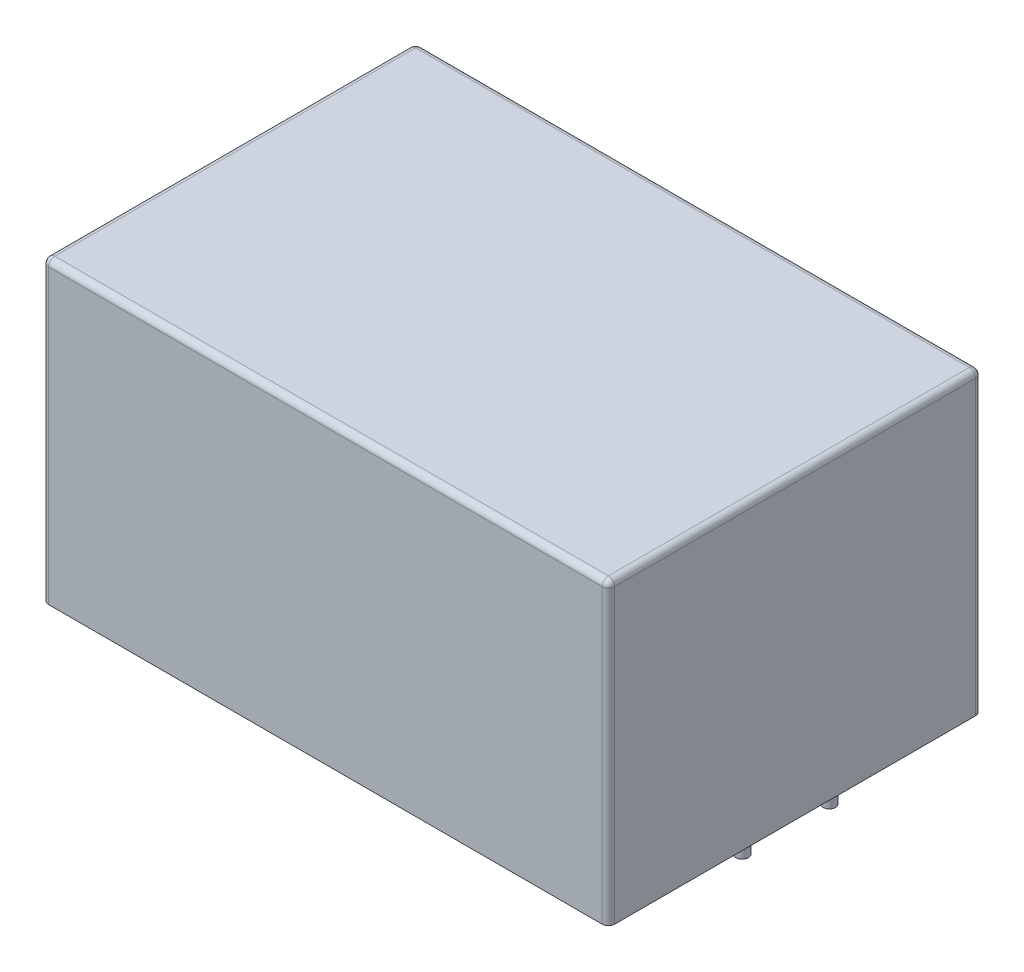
ISO-10303-21;
HEADER;
FILE_DESCRIPTION(('STEP AP214'),'2;1');
FILE_NAME('part.step','',(''),(''),'','','');
FILE_SCHEMA(('AUTOMOTIVE_DESIGN { 1 0 10303 214 1 1 1 1 }'));
ENDSEC;
DATA;
#1=APPLICATION_CONTEXT('core data for automotive mechanical design processes');
#2=APPLICATION_PROTOCOL_DEFINITION('international standard','automotive_design',2000,#1);
#3=PRODUCT_CONTEXT('',#1,'mechanical');
#4=PRODUCT('Part','Part','',(#3));
#5=PRODUCT_RELATED_PRODUCT_CATEGORY('part','',(#4));
#6=PRODUCT_DEFINITION_FORMATION('','',#4);
#7=PRODUCT_DEFINITION_CONTEXT('part definition',#1,'design');
#8=PRODUCT_DEFINITION('design','',#6,#7);
#9=PRODUCT_DEFINITION_SHAPE('','',#8);
#10=(LENGTH_UNIT() NAMED_UNIT(*) SI_UNIT(.MILLI.,.METRE.));
#11=(NAMED_UNIT(*) PLANE_ANGLE_UNIT() SI_UNIT($,.RADIAN.));
#12=(NAMED_UNIT(*) SI_UNIT($,.STERADIAN.) SOLID_ANGLE_UNIT());
#13=UNCERTAINTY_MEASURE_WITH_UNIT(LENGTH_MEASURE(1.E-05),#10,'distance_accuracy_value','');
#14=(GEOMETRIC_REPRESENTATION_CONTEXT(3) GLOBAL_UNCERTAINTY_ASSIGNED_CONTEXT((#13)) GLOBAL_UNIT_ASSIGNED_CONTEXT((#10,
#11,#12)) REPRESENTATION_CONTEXT('',''));
#15=CARTESIAN_POINT('',(0.,0.,0.));
#16=DIRECTION('',(0.,0.,1.));
#17=DIRECTION('',(1.,0.,0.));
#18=AXIS2_PLACEMENT_3D('',#15,#16,#17);
#19=CARTESIAN_POINT('',(-22.75,24.,-15.));
#20=DIRECTION('',(1.,0.,0.));
#21=DIRECTION('',(0.,0.,-1.));
#22=AXIS2_PLACEMENT_3D('',#19,#20,#21);
#23=PLANE('',#22);
#24=DIRECTION('',(0.,0.,1.));
#25=VECTOR('',#24,1.);
#26=CARTESIAN_POINT('',(-22.75,23.5,-15.));
#27=LINE('',#26,#25);
#28=CARTESIAN_POINT('',(-22.75,23.5,14.5));
#29=VERTEX_POINT('',#28);
#30=CARTESIAN_POINT('',(-22.75,23.5,-14.5));
#31=VERTEX_POINT('',#30);
#32=EDGE_CURVE('E51',#29,#31,#27,.F.);
#33=ORIENTED_EDGE('',*,*,#32,.T.);
#34=DIRECTION('',(0.,-1.,0.));
#35=VECTOR('',#34,1.);
#36=CARTESIAN_POINT('',(-22.75,24.,-14.5));
#37=LINE('',#36,#35);
#38=CARTESIAN_POINT('',(-22.75,0.,-14.5));
#39=VERTEX_POINT('',#38);
#40=EDGE_CURVE('E171',#31,#39,#37,.T.);
#41=ORIENTED_EDGE('',*,*,#40,.T.);
#42=DIRECTION('',(0.,0.,1.));
#43=VECTOR('',#42,1.);
#44=CARTESIAN_POINT('',(-22.75,0.,-15.));
#45=LINE('',#44,#43);
#46=CARTESIAN_POINT('',(-22.75,0.,14.5));
#47=VERTEX_POINT('',#46);
#48=EDGE_CURVE('E200',#39,#47,#45,.T.);
#49=ORIENTED_EDGE('',*,*,#48,.T.);
#50=DIRECTION('',(0.,-1.,0.));
#51=VECTOR('',#50,1.);
#52=CARTESIAN_POINT('',(-22.75,24.,14.5));
#53=LINE('',#52,#51);
#54=EDGE_CURVE('E56',#47,#29,#53,.F.);
#55=ORIENTED_EDGE('',*,*,#54,.T.);
#56=EDGE_LOOP('',(#33,#41,#49,#55));
#57=FACE_BOUND('',#56,.T.);
#58=ADVANCED_FACE('F34',(#57),#23,.F.);
#59=CARTESIAN_POINT('',(22.75,24.,15.));
#60=DIRECTION('',(0.,0.,-1.));
#61=DIRECTION('',(-1.,0.,0.));
#62=AXIS2_PLACEMENT_3D('',#59,#60,#61);
#63=PLANE('',#62);
#64=DIRECTION('',(1.,0.,0.));
#65=VECTOR('',#64,1.);
#66=CARTESIAN_POINT('',(22.75,23.5,15.));
#67=LINE('',#66,#65);
#68=CARTESIAN_POINT('',(22.25,23.5,15.));
#69=VERTEX_POINT('',#68);
#70=CARTESIAN_POINT('',(-22.25,23.5,15.));
#71=VERTEX_POINT('',#70);
#72=EDGE_CURVE('E165',#69,#71,#67,.F.);
#73=ORIENTED_EDGE('',*,*,#72,.T.);
#74=DIRECTION('',(0.,-1.,0.));
#75=VECTOR('',#74,1.);
#76=CARTESIAN_POINT('',(-22.25,24.,15.));
#77=LINE('',#76,#75);
#78=CARTESIAN_POINT('',(-22.25,0.,15.));
#79=VERTEX_POINT('',#78);
#80=EDGE_CURVE('E167',#71,#79,#77,.T.);
#81=ORIENTED_EDGE('',*,*,#80,.T.);
#82=DIRECTION('',(1.,0.,0.));
#83=VECTOR('',#82,1.);
#84=CARTESIAN_POINT('',(22.75,0.,15.));
#85=LINE('',#84,#83);
#86=CARTESIAN_POINT('',(22.25,0.,15.));
#87=VERTEX_POINT('',#86);
#88=EDGE_CURVE('E202',#79,#87,#85,.T.);
#89=ORIENTED_EDGE('',*,*,#88,.T.);
#90=DIRECTION('',(0.,-1.,0.));
#91=VECTOR('',#90,1.);
#92=CARTESIAN_POINT('',(22.25,24.,15.));
#93=LINE('',#92,#91);
#94=EDGE_CURVE('E163',#87,#69,#93,.F.);
#95=ORIENTED_EDGE('',*,*,#94,.T.);
#96=EDGE_LOOP('',(#73,#81,#89,#95));
#97=FACE_BOUND('',#96,.T.);
#98=ADVANCED_FACE('F257',(#97),#63,.F.);
#99=CARTESIAN_POINT('',(22.75,24.,-15.));
#100=DIRECTION('',(-1.,0.,0.));
#101=DIRECTION('',(0.,0.,1.));
#102=AXIS2_PLACEMENT_3D('',#99,#100,#101);
#103=PLANE('',#102);
#104=DIRECTION('',(0.,0.,-1.));
#105=VECTOR('',#104,1.);
#106=CARTESIAN_POINT('',(22.75,0.,-15.));
#107=LINE('',#106,#105);
#108=CARTESIAN_POINT('',(22.75,0.,14.5));
#109=VERTEX_POINT('',#108);
#110=CARTESIAN_POINT('',(22.75,0.,-14.5));
#111=VERTEX_POINT('',#110);
#112=EDGE_CURVE('E206',#109,#111,#107,.T.);
#113=ORIENTED_EDGE('',*,*,#112,.T.);
#114=DIRECTION('',(0.,-1.,0.));
#115=VECTOR('',#114,1.);
#116=CARTESIAN_POINT('',(22.75,24.,-14.5));
#117=LINE('',#116,#115);
#118=CARTESIAN_POINT('',(22.75,23.5,-14.5));
#119=VERTEX_POINT('',#118);
#120=EDGE_CURVE('E161',#111,#119,#117,.F.);
#121=ORIENTED_EDGE('',*,*,#120,.T.);
#122=DIRECTION('',(0.,0.,-1.));
#123=VECTOR('',#122,1.);
#124=CARTESIAN_POINT('',(22.75,23.5,-15.));
#125=LINE('',#124,#123);
#126=CARTESIAN_POINT('',(22.75,23.5,14.5));
#127=VERTEX_POINT('',#126);
#128=EDGE_CURVE('E159',#119,#127,#125,.F.);
#129=ORIENTED_EDGE('',*,*,#128,.T.);
#130=DIRECTION('',(0.,-1.,0.));
#131=VECTOR('',#130,1.);
#132=CARTESIAN_POINT('',(22.75,24.,14.5));
#133=LINE('',#132,#131);
#134=EDGE_CURVE('E157',#127,#109,#133,.T.);
#135=ORIENTED_EDGE('',*,*,#134,.T.);
#136=EDGE_LOOP('',(#113,#121,#129,#135));
#137=FACE_BOUND('',#136,.T.);
#138=ADVANCED_FACE('F262',(#137),#103,.F.);
#139=CARTESIAN_POINT('',(22.75,24.,-15.));
#140=DIRECTION('',(0.,0.,1.));
#141=DIRECTION('',(1.,0.,0.));
#142=AXIS2_PLACEMENT_3D('',#139,#140,#141);
#143=PLANE('',#142);
#144=DIRECTION('',(-1.,0.,0.));
#145=VECTOR('',#144,1.);
#146=CARTESIAN_POINT('',(22.75,23.5,-15.));
#147=LINE('',#146,#145);
#148=CARTESIAN_POINT('',(-22.25,23.5,-15.));
#149=VERTEX_POINT('',#148);
#150=CARTESIAN_POINT('',(22.25,23.5,-15.));
#151=VERTEX_POINT('',#150);
#152=EDGE_CURVE('E119',#149,#151,#147,.F.);
#153=ORIENTED_EDGE('',*,*,#152,.T.);
#154=DIRECTION('',(0.,-1.,0.));
#155=VECTOR('',#154,1.);
#156=CARTESIAN_POINT('',(22.25,24.,-15.));
#157=LINE('',#156,#155);
#158=CARTESIAN_POINT('',(22.25,0.,-15.));
#159=VERTEX_POINT('',#158);
#160=EDGE_CURVE('E155',#151,#159,#157,.T.);
#161=ORIENTED_EDGE('',*,*,#160,.T.);
#162=DIRECTION('',(-1.,0.,0.));
#163=VECTOR('',#162,1.);
#164=CARTESIAN_POINT('',(22.75,0.,-15.));
#165=LINE('',#164,#163);
#166=CARTESIAN_POINT('',(-22.25,0.,-15.));
#167=VERTEX_POINT('',#166);
#168=EDGE_CURVE('E142',#159,#167,#165,.T.);
#169=ORIENTED_EDGE('',*,*,#168,.T.);
#170=DIRECTION('',(0.,-1.,0.));
#171=VECTOR('',#170,1.);
#172=CARTESIAN_POINT('',(-22.25,24.,-15.));
#173=LINE('',#172,#171);
#174=EDGE_CURVE('E148',#167,#149,#173,.F.);
#175=ORIENTED_EDGE('',*,*,#174,.T.);
#176=EDGE_LOOP('',(#153,#161,#169,#175));
#177=FACE_BOUND('',#176,.T.);
#178=ADVANCED_FACE('F234',(#177),#143,.F.);
#179=CARTESIAN_POINT('',(0.,24.,0.));
#180=DIRECTION('',(0.,-1.,0.));
#181=DIRECTION('',(0.,0.,-1.));
#182=AXIS2_PLACEMENT_3D('',#179,#180,#181);
#183=PLANE('',#182);
#184=DIRECTION('',(0.,0.,-1.));
#185=VECTOR('',#184,1.);
#186=CARTESIAN_POINT('',(22.25,24.,0.));
#187=LINE('',#186,#185);
#188=CARTESIAN_POINT('',(22.25,24.,14.5));
#189=VERTEX_POINT('',#188);
#190=CARTESIAN_POINT('',(22.25,24.,-14.5));
#191=VERTEX_POINT('',#190);
#192=EDGE_CURVE('E146',#189,#191,#187,.T.);
#193=ORIENTED_EDGE('',*,*,#192,.T.);
#194=DIRECTION('',(-1.,0.,0.));
#195=VECTOR('',#194,1.);
#196=CARTESIAN_POINT('',(0.,24.,-14.5));
#197=LINE('',#196,#195);
#198=CARTESIAN_POINT('',(-22.25,24.,-14.5));
#199=VERTEX_POINT('',#198);
#200=EDGE_CURVE('E117',#191,#199,#197,.T.);
#201=ORIENTED_EDGE('',*,*,#200,.T.);
#202=DIRECTION('',(0.,0.,1.));
#203=VECTOR('',#202,1.);
#204=CARTESIAN_POINT('',(-22.25,24.,0.));
#205=LINE('',#204,#203);
#206=CARTESIAN_POINT('',(-22.25,24.,14.5));
#207=VERTEX_POINT('',#206);
#208=EDGE_CURVE('E135',#199,#207,#205,.T.);
#209=ORIENTED_EDGE('',*,*,#208,.T.);
#210=DIRECTION('',(1.,0.,0.));
#211=VECTOR('',#210,1.);
#212=CARTESIAN_POINT('',(0.,24.,14.5));
#213=LINE('',#212,#211);
#214=EDGE_CURVE('E141',#207,#189,#213,.T.);
#215=ORIENTED_EDGE('',*,*,#214,.T.);
#216=EDGE_LOOP('',(#193,#201,#209,#215));
#217=FACE_BOUND('',#216,.T.);
#218=ADVANCED_FACE('F144',(#217),#183,.F.);
#219=CARTESIAN_POINT('',(0.,0.,0.));
#220=DIRECTION('',(0.,-1.,0.));
#221=DIRECTION('',(0.,0.,-1.));
#222=AXIS2_PLACEMENT_3D('',#219,#220,#221);
#223=PLANE('',#222);
#224=CARTESIAN_POINT('',(19.5,0.,-6.));
#225=DIRECTION('',(0.,-1.,0.));
#226=DIRECTION('',(0.,0.,-1.));
#227=AXIS2_PLACEMENT_3D('',#224,#225,#226);
#228=CIRCLE('',#227,0.499999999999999);
#229=CARTESIAN_POINT('',(19.5,0.,-6.5));
#230=VERTEX_POINT('',#229);
#231=EDGE_CURVE('E496',#230,#230,#228,.T.);
#232=ORIENTED_EDGE('',*,*,#231,.F.);
#233=EDGE_LOOP('',(#232));
#234=FACE_BOUND('',#233,.T.);
#235=CARTESIAN_POINT('',(19.5,0.,0.999999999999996));
#236=DIRECTION('',(0.,-1.,0.));
#237=DIRECTION('',(0.,0.,-1.));
#238=AXIS2_PLACEMENT_3D('',#235,#236,#237);
#239=CIRCLE('',#238,0.499999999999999);
#240=CARTESIAN_POINT('',(19.5,0.,0.499999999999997));
#241=VERTEX_POINT('',#240);
#242=EDGE_CURVE('E500',#241,#241,#239,.T.);
#243=ORIENTED_EDGE('',*,*,#242,.F.);
#244=EDGE_LOOP('',(#243));
#245=FACE_BOUND('',#244,.T.);
#246=CARTESIAN_POINT('',(-19.5,0.,-6.));
#247=DIRECTION('',(0.,-1.,0.));
#248=DIRECTION('',(0.,0.,-1.));
#249=AXIS2_PLACEMENT_3D('',#246,#247,#248);
#250=CIRCLE('',#249,0.499999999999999);
#251=CARTESIAN_POINT('',(-19.5,0.,-6.5));
#252=VERTEX_POINT('',#251);
#253=EDGE_CURVE('E504',#252,#252,#250,.T.);
#254=ORIENTED_EDGE('',*,*,#253,.F.);
#255=EDGE_LOOP('',(#254));
#256=FACE_BOUND('',#255,.T.);
#257=CARTESIAN_POINT('',(-19.5,0.,6.));
#258=DIRECTION('',(0.,-1.,0.));
#259=DIRECTION('',(0.,0.,-1.));
#260=AXIS2_PLACEMENT_3D('',#257,#258,#259);
#261=CIRCLE('',#260,0.499999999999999);
#262=CARTESIAN_POINT('',(-19.5,0.,5.5));
#263=VERTEX_POINT('',#262);
#264=EDGE_CURVE('E209',#263,#263,#261,.T.);
#265=ORIENTED_EDGE('',*,*,#264,.F.);
#266=EDGE_LOOP('',(#265));
#267=FACE_BOUND('',#266,.T.);
#268=ORIENTED_EDGE('',*,*,#168,.F.);
#269=CARTESIAN_POINT('',(22.25,0.,-14.5));
#270=DIRECTION('',(0.,-1.,0.));
#271=DIRECTION('',(0.,0.,-1.));
#272=AXIS2_PLACEMENT_3D('',#269,#270,#271);
#273=CIRCLE('',#272,0.5);
#274=EDGE_CURVE('E11',#159,#111,#273,.T.);
#275=ORIENTED_EDGE('',*,*,#274,.T.);
#276=ORIENTED_EDGE('',*,*,#112,.F.);
#277=CARTESIAN_POINT('',(22.25,0.,14.5));
#278=DIRECTION('',(0.,-1.,0.));
#279=DIRECTION('',(0.,0.,-1.));
#280=AXIS2_PLACEMENT_3D('',#277,#278,#279);
#281=CIRCLE('',#280,0.5);
#282=EDGE_CURVE('E173',#109,#87,#281,.T.);
#283=ORIENTED_EDGE('',*,*,#282,.T.);
#284=ORIENTED_EDGE('',*,*,#88,.F.);
#285=CARTESIAN_POINT('',(-22.25,0.,14.5));
#286=DIRECTION('',(0.,-1.,0.));
#287=DIRECTION('',(0.,0.,-1.));
#288=AXIS2_PLACEMENT_3D('',#285,#286,#287);
#289=CIRCLE('',#288,0.5);
#290=EDGE_CURVE('E175',#79,#47,#289,.T.);
#291=ORIENTED_EDGE('',*,*,#290,.T.);
#292=ORIENTED_EDGE('',*,*,#48,.F.);
#293=CARTESIAN_POINT('',(-22.25,0.,-14.5));
#294=DIRECTION('',(0.,-1.,0.));
#295=DIRECTION('',(0.,0.,-1.));
#296=AXIS2_PLACEMENT_3D('',#293,#294,#295);
#297=CIRCLE('',#296,0.5);
#298=EDGE_CURVE('E43',#39,#167,#297,.T.);
#299=ORIENTED_EDGE('',*,*,#298,.T.);
#300=EDGE_LOOP('',(#268,#275,#276,#283,#284,#291,#292,#299));
#301=FACE_BOUND('',#300,.T.);
#302=ADVANCED_FACE('F240',(#234,#245,#256,#267,#301),#223,.T.);
#303=CARTESIAN_POINT('',(22.25,24.,14.5));
#304=DIRECTION('',(0.,-1.,0.));
#305=DIRECTION('',(0.,0.,-1.));
#306=AXIS2_PLACEMENT_3D('',#303,#304,#305);
#307=CYLINDRICAL_SURFACE('',#306,0.5);
#308=ORIENTED_EDGE('',*,*,#282,.F.);
#309=ORIENTED_EDGE('',*,*,#134,.F.);
#310=CARTESIAN_POINT('',(22.25,23.5,14.5));
#311=DIRECTION('',(0.,1.,0.));
#312=DIRECTION('',(0.,0.,1.));
#313=AXIS2_PLACEMENT_3D('',#310,#311,#312);
#314=CIRCLE('',#313,0.5);
#315=EDGE_CURVE('E38',#69,#127,#314,.T.);
#316=ORIENTED_EDGE('',*,*,#315,.F.);
#317=ORIENTED_EDGE('',*,*,#94,.F.);
#318=EDGE_LOOP('',(#308,#309,#316,#317));
#319=FACE_BOUND('',#318,.T.);
#320=ADVANCED_FACE('F36',(#319),#307,.T.);
#321=CARTESIAN_POINT('',(0.,23.5,14.5));
#322=DIRECTION('',(1.,0.,0.));
#323=DIRECTION('',(0.,0.,-1.));
#324=AXIS2_PLACEMENT_3D('',#321,#322,#323);
#325=CYLINDRICAL_SURFACE('',#324,0.5);
#326=CARTESIAN_POINT('',(-22.25,23.5,14.5));
#327=DIRECTION('',(-1.,0.,0.));
#328=DIRECTION('',(0.,-1.,0.));
#329=AXIS2_PLACEMENT_3D('',#326,#327,#328);
#330=CIRCLE('',#329,0.5);
#331=EDGE_CURVE('E192',#71,#207,#330,.T.);
#332=ORIENTED_EDGE('',*,*,#331,.F.);
#333=ORIENTED_EDGE('',*,*,#72,.F.);
#334=CARTESIAN_POINT('',(22.25,23.5,14.5));
#335=DIRECTION('',(1.,0.,0.));
#336=DIRECTION('',(0.,0.,-1.));
#337=AXIS2_PLACEMENT_3D('',#334,#335,#336);
#338=CIRCLE('',#337,0.5);
#339=EDGE_CURVE('E194',#189,#69,#338,.T.);
#340=ORIENTED_EDGE('',*,*,#339,.F.);
#341=ORIENTED_EDGE('',*,*,#214,.F.);
#342=EDGE_LOOP('',(#332,#333,#340,#341));
#343=FACE_BOUND('',#342,.T.);
#344=ADVANCED_FACE('F218',(#343),#325,.T.);
#345=CARTESIAN_POINT('',(-22.25,24.,14.5));
#346=DIRECTION('',(0.,-1.,0.));
#347=DIRECTION('',(0.,0.,-1.));
#348=AXIS2_PLACEMENT_3D('',#345,#346,#347);
#349=CYLINDRICAL_SURFACE('',#348,0.5);
#350=ORIENTED_EDGE('',*,*,#290,.F.);
#351=ORIENTED_EDGE('',*,*,#80,.F.);
#352=CARTESIAN_POINT('',(-22.25,23.5,14.5));
#353=DIRECTION('',(0.,1.,0.));
#354=DIRECTION('',(0.,0.,1.));
#355=AXIS2_PLACEMENT_3D('',#352,#353,#354);
#356=CIRCLE('',#355,0.5);
#357=EDGE_CURVE('E189',#29,#71,#356,.T.);
#358=ORIENTED_EDGE('',*,*,#357,.F.);
#359=ORIENTED_EDGE('',*,*,#54,.F.);
#360=EDGE_LOOP('',(#350,#351,#358,#359));
#361=FACE_BOUND('',#360,.T.);
#362=ADVANCED_FACE('F245',(#361),#349,.T.);
#363=CARTESIAN_POINT('',(22.25,23.5,14.5));
#364=DIRECTION('',(0.,0.,1.));
#365=DIRECTION('',(1.,0.,0.));
#366=AXIS2_PLACEMENT_3D('',#363,#364,#365);
#367=SPHERICAL_SURFACE('',#366,0.5);
#368=ORIENTED_EDGE('',*,*,#339,.T.);
#369=ORIENTED_EDGE('',*,*,#315,.T.);
#370=CARTESIAN_POINT('',(22.25,23.5,14.5));
#371=DIRECTION('',(0.,0.,1.));
#372=DIRECTION('',(0.,-1.,0.));
#373=AXIS2_PLACEMENT_3D('',#370,#371,#372);
#374=CIRCLE('',#373,0.5);
#375=EDGE_CURVE('E186',#189,#127,#374,.F.);
#376=ORIENTED_EDGE('',*,*,#375,.F.);
#377=EDGE_LOOP('',(#368,#369,#376));
#378=FACE_BOUND('',#377,.T.);
#379=ADVANCED_FACE('F219',(#378),#367,.T.);
#380=CARTESIAN_POINT('',(-22.25,23.5,14.5));
#381=DIRECTION('',(0.,0.,1.));
#382=DIRECTION('',(1.,0.,0.));
#383=AXIS2_PLACEMENT_3D('',#380,#381,#382);
#384=SPHERICAL_SURFACE('',#383,0.5);
#385=ORIENTED_EDGE('',*,*,#357,.T.);
#386=ORIENTED_EDGE('',*,*,#331,.T.);
#387=CARTESIAN_POINT('',(-22.25,23.5,14.5));
#388=DIRECTION('',(0.,0.,1.));
#389=DIRECTION('',(1.,0.,0.));
#390=AXIS2_PLACEMENT_3D('',#387,#388,#389);
#391=CIRCLE('',#390,0.5);
#392=EDGE_CURVE('E138',#29,#207,#391,.F.);
#393=ORIENTED_EDGE('',*,*,#392,.F.);
#394=EDGE_LOOP('',(#385,#386,#393));
#395=FACE_BOUND('',#394,.T.);
#396=ADVANCED_FACE('F247',(#395),#384,.T.);
#397=CARTESIAN_POINT('',(22.25,24.,-14.5));
#398=DIRECTION('',(0.,-1.,0.));
#399=DIRECTION('',(0.,0.,-1.));
#400=AXIS2_PLACEMENT_3D('',#397,#398,#399);
#401=CYLINDRICAL_SURFACE('',#400,0.5);
#402=ORIENTED_EDGE('',*,*,#274,.F.);
#403=ORIENTED_EDGE('',*,*,#160,.F.);
#404=CARTESIAN_POINT('',(22.25,23.5,-14.5));
#405=DIRECTION('',(0.,1.,0.));
#406=DIRECTION('',(0.,0.,1.));
#407=AXIS2_PLACEMENT_3D('',#404,#405,#406);
#408=CIRCLE('',#407,0.5);
#409=EDGE_CURVE('E182',#119,#151,#408,.T.);
#410=ORIENTED_EDGE('',*,*,#409,.F.);
#411=ORIENTED_EDGE('',*,*,#120,.F.);
#412=EDGE_LOOP('',(#402,#403,#410,#411));
#413=FACE_BOUND('',#412,.T.);
#414=ADVANCED_FACE('F231',(#413),#401,.T.);
#415=CARTESIAN_POINT('',(22.25,23.5,0.));
#416=DIRECTION('',(0.,0.,-1.));
#417=DIRECTION('',(-1.,0.,0.));
#418=AXIS2_PLACEMENT_3D('',#415,#416,#417);
#419=CYLINDRICAL_SURFACE('',#418,0.5);
#420=ORIENTED_EDGE('',*,*,#375,.T.);
#421=ORIENTED_EDGE('',*,*,#128,.F.);
#422=CARTESIAN_POINT('',(22.25,23.5,-14.5));
#423=DIRECTION('',(0.,0.,-1.));
#424=DIRECTION('',(-1.,0.,0.));
#425=AXIS2_PLACEMENT_3D('',#422,#423,#424);
#426=CIRCLE('',#425,0.5);
#427=EDGE_CURVE('E132',#191,#119,#426,.T.);
#428=ORIENTED_EDGE('',*,*,#427,.F.);
#429=ORIENTED_EDGE('',*,*,#192,.F.);
#430=EDGE_LOOP('',(#420,#421,#428,#429));
#431=FACE_BOUND('',#430,.T.);
#432=ADVANCED_FACE('F222',(#431),#419,.T.);
#433=CARTESIAN_POINT('',(-22.25,23.5,0.));
#434=DIRECTION('',(0.,0.,1.));
#435=DIRECTION('',(1.,0.,0.));
#436=AXIS2_PLACEMENT_3D('',#433,#434,#435);
#437=CYLINDRICAL_SURFACE('',#436,0.5);
#438=ORIENTED_EDGE('',*,*,#392,.T.);
#439=ORIENTED_EDGE('',*,*,#208,.F.);
#440=CARTESIAN_POINT('',(-22.25,23.5,-14.5));
#441=DIRECTION('',(0.,0.,-1.));
#442=DIRECTION('',(-1.,0.,0.));
#443=AXIS2_PLACEMENT_3D('',#440,#441,#442);
#444=CIRCLE('',#443,0.5);
#445=EDGE_CURVE('E126',#31,#199,#444,.T.);
#446=ORIENTED_EDGE('',*,*,#445,.F.);
#447=ORIENTED_EDGE('',*,*,#32,.F.);
#448=EDGE_LOOP('',(#438,#439,#446,#447));
#449=FACE_BOUND('',#448,.T.);
#450=ADVANCED_FACE('F136',(#449),#437,.T.);
#451=CARTESIAN_POINT('',(-22.25,24.,-14.5));
#452=DIRECTION('',(0.,-1.,0.));
#453=DIRECTION('',(0.,0.,-1.));
#454=AXIS2_PLACEMENT_3D('',#451,#452,#453);
#455=CYLINDRICAL_SURFACE('',#454,0.5);
#456=ORIENTED_EDGE('',*,*,#298,.F.);
#457=ORIENTED_EDGE('',*,*,#40,.F.);
#458=CARTESIAN_POINT('',(-22.25,23.5,-14.5));
#459=DIRECTION('',(0.,1.,0.));
#460=DIRECTION('',(0.,0.,1.));
#461=AXIS2_PLACEMENT_3D('',#458,#459,#460);
#462=CIRCLE('',#461,0.5);
#463=EDGE_CURVE('E130',#149,#31,#462,.T.);
#464=ORIENTED_EDGE('',*,*,#463,.F.);
#465=ORIENTED_EDGE('',*,*,#174,.F.);
#466=EDGE_LOOP('',(#456,#457,#464,#465));
#467=FACE_BOUND('',#466,.T.);
#468=ADVANCED_FACE('F238',(#467),#455,.T.);
#469=CARTESIAN_POINT('',(22.25,23.5,-14.5));
#470=DIRECTION('',(1.,0.,0.));
#471=DIRECTION('',(0.,0.,-1.));
#472=AXIS2_PLACEMENT_3D('',#469,#470,#471);
#473=SPHERICAL_SURFACE('',#472,0.5);
#474=ORIENTED_EDGE('',*,*,#427,.T.);
#475=ORIENTED_EDGE('',*,*,#409,.T.);
#476=CARTESIAN_POINT('',(22.25,23.5,-14.5));
#477=DIRECTION('',(1.,0.,0.));
#478=DIRECTION('',(0.,0.,-1.));
#479=AXIS2_PLACEMENT_3D('',#476,#477,#478);
#480=CIRCLE('',#479,0.5);
#481=EDGE_CURVE('E122',#191,#151,#480,.F.);
#482=ORIENTED_EDGE('',*,*,#481,.F.);
#483=EDGE_LOOP('',(#474,#475,#482));
#484=FACE_BOUND('',#483,.T.);
#485=ADVANCED_FACE('F226',(#484),#473,.T.);
#486=CARTESIAN_POINT('',(-22.25,23.5,-14.5));
#487=DIRECTION('',(-1.,0.,0.));
#488=DIRECTION('',(0.,0.,1.));
#489=AXIS2_PLACEMENT_3D('',#486,#487,#488);
#490=SPHERICAL_SURFACE('',#489,0.5);
#491=ORIENTED_EDGE('',*,*,#463,.T.);
#492=ORIENTED_EDGE('',*,*,#445,.T.);
#493=CARTESIAN_POINT('',(-22.25,23.5,-14.5));
#494=DIRECTION('',(-1.,0.,0.));
#495=DIRECTION('',(0.,0.,1.));
#496=AXIS2_PLACEMENT_3D('',#493,#494,#495);
#497=CIRCLE('',#496,0.5);
#498=EDGE_CURVE('E113',#149,#199,#497,.F.);
#499=ORIENTED_EDGE('',*,*,#498,.F.);
#500=EDGE_LOOP('',(#491,#492,#499));
#501=FACE_BOUND('',#500,.T.);
#502=ADVANCED_FACE('F128',(#501),#490,.T.);
#503=CARTESIAN_POINT('',(0.,23.5,-14.5));
#504=DIRECTION('',(-1.,0.,0.));
#505=DIRECTION('',(0.,0.,1.));
#506=AXIS2_PLACEMENT_3D('',#503,#504,#505);
#507=CYLINDRICAL_SURFACE('',#506,0.5);
#508=ORIENTED_EDGE('',*,*,#481,.T.);
#509=ORIENTED_EDGE('',*,*,#152,.F.);
#510=ORIENTED_EDGE('',*,*,#498,.T.);
#511=ORIENTED_EDGE('',*,*,#200,.F.);
#512=EDGE_LOOP('',(#508,#509,#510,#511));
#513=FACE_BOUND('',#512,.T.);
#514=ADVANCED_FACE('F115',(#513),#507,.T.);
#515=CARTESIAN_POINT('',(-19.5,-3.5,6.));
#516=DIRECTION('',(0.,1.,0.));
#517=DIRECTION('',(0.,0.,1.));
#518=AXIS2_PLACEMENT_3D('',#515,#516,#517);
#519=CYLINDRICAL_SURFACE('',#518,0.499999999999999);
#520=CARTESIAN_POINT('',(-19.5,-3.5,6.));
#521=DIRECTION('',(0.,-1.,0.));
#522=DIRECTION('',(0.,0.,-1.));
#523=AXIS2_PLACEMENT_3D('',#520,#521,#522);
#524=CIRCLE('',#523,0.499999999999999);
#525=CARTESIAN_POINT('',(-19.5,-3.5,5.5));
#526=VERTEX_POINT('',#525);
#527=EDGE_CURVE('E123',#526,#526,#524,.T.);
#528=ORIENTED_EDGE('',*,*,#527,.F.);
#529=EDGE_LOOP('',(#528));
#530=FACE_BOUND('',#529,.T.);
#531=ORIENTED_EDGE('',*,*,#264,.T.);
#532=EDGE_LOOP('',(#531));
#533=FACE_BOUND('',#532,.T.);
#534=ADVANCED_FACE('F269',(#530,#533),#519,.T.);
#535=CARTESIAN_POINT('',(-19.5,-3.5,6.));
#536=DIRECTION('',(0.,-1.,0.));
#537=DIRECTION('',(0.,0.,-1.));
#538=AXIS2_PLACEMENT_3D('',#535,#536,#537);
#539=PLANE('',#538);
#540=ORIENTED_EDGE('',*,*,#527,.T.);
#541=EDGE_LOOP('',(#540));
#542=FACE_BOUND('',#541,.T.);
#543=ADVANCED_FACE('F310',(#542),#539,.T.);
#544=CARTESIAN_POINT('',(-19.5,-3.5,-6.));
#545=DIRECTION('',(0.,1.,0.));
#546=DIRECTION('',(0.,0.,1.));
#547=AXIS2_PLACEMENT_3D('',#544,#545,#546);
#548=CYLINDRICAL_SURFACE('',#547,0.499999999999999);
#549=CARTESIAN_POINT('',(-19.5,-3.5,-6.));
#550=DIRECTION('',(0.,-1.,0.));
#551=DIRECTION('',(0.,0.,-1.));
#552=AXIS2_PLACEMENT_3D('',#549,#550,#551);
#553=CIRCLE('',#552,0.499999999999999);
#554=CARTESIAN_POINT('',(-19.5,-3.5,-6.5));
#555=VERTEX_POINT('',#554);
#556=EDGE_CURVE('E508',#555,#555,#553,.T.);
#557=ORIENTED_EDGE('',*,*,#556,.F.);
#558=EDGE_LOOP('',(#557));
#559=FACE_BOUND('',#558,.T.);
#560=ORIENTED_EDGE('',*,*,#253,.T.);
#561=EDGE_LOOP('',(#560));
#562=FACE_BOUND('',#561,.T.);
#563=ADVANCED_FACE('F318',(#559,#562),#548,.T.);
#564=CARTESIAN_POINT('',(-19.5,-3.5,-6.));
#565=DIRECTION('',(0.,-1.,0.));
#566=DIRECTION('',(0.,0.,-1.));
#567=AXIS2_PLACEMENT_3D('',#564,#565,#566);
#568=PLANE('',#567);
#569=ORIENTED_EDGE('',*,*,#556,.T.);
#570=EDGE_LOOP('',(#569));
#571=FACE_BOUND('',#570,.T.);
#572=ADVANCED_FACE('F326',(#571),#568,.T.);
#573=CARTESIAN_POINT('',(19.5,-3.5,0.999999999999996));
#574=DIRECTION('',(0.,1.,0.));
#575=DIRECTION('',(0.,0.,1.));
#576=AXIS2_PLACEMENT_3D('',#573,#574,#575);
#577=CYLINDRICAL_SURFACE('',#576,0.499999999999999);
#578=CARTESIAN_POINT('',(19.5,-3.5,0.999999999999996));
#579=DIRECTION('',(0.,-1.,0.));
#580=DIRECTION('',(0.,0.,-1.));
#581=AXIS2_PLACEMENT_3D('',#578,#579,#580);
#582=CIRCLE('',#581,0.499999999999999);
#583=CARTESIAN_POINT('',(19.5,-3.5,0.499999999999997));
#584=VERTEX_POINT('',#583);
#585=EDGE_CURVE('E513',#584,#584,#582,.T.);
#586=ORIENTED_EDGE('',*,*,#585,.F.);
#587=EDGE_LOOP('',(#586));
#588=FACE_BOUND('',#587,.T.);
#589=ORIENTED_EDGE('',*,*,#242,.T.);
#590=EDGE_LOOP('',(#589));
#591=FACE_BOUND('',#590,.T.);
#592=ADVANCED_FACE('F334',(#588,#591),#577,.T.);
#593=CARTESIAN_POINT('',(19.5,-3.5,0.999999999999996));
#594=DIRECTION('',(0.,-1.,0.));
#595=DIRECTION('',(0.,0.,-1.));
#596=AXIS2_PLACEMENT_3D('',#593,#594,#595);
#597=PLANE('',#596);
#598=ORIENTED_EDGE('',*,*,#585,.T.);
#599=EDGE_LOOP('',(#598));
#600=FACE_BOUND('',#599,.T.);
#601=ADVANCED_FACE('F342',(#600),#597,.T.);
#602=CARTESIAN_POINT('',(19.5,-3.5,-6.));
#603=DIRECTION('',(0.,1.,0.));
#604=DIRECTION('',(0.,0.,1.));
#605=AXIS2_PLACEMENT_3D('',#602,#603,#604);
#606=CYLINDRICAL_SURFACE('',#605,0.499999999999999);
#607=CARTESIAN_POINT('',(19.5,-3.5,-6.));
#608=DIRECTION('',(0.,-1.,0.));
#609=DIRECTION('',(0.,0.,-1.));
#610=AXIS2_PLACEMENT_3D('',#607,#608,#609);
#611=CIRCLE('',#610,0.499999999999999);
#612=CARTESIAN_POINT('',(19.5,-3.5,-6.5));
#613=VERTEX_POINT('',#612);
#614=EDGE_CURVE('E517',#613,#613,#611,.T.);
#615=ORIENTED_EDGE('',*,*,#614,.F.);
#616=EDGE_LOOP('',(#615));
#617=FACE_BOUND('',#616,.T.);
#618=ORIENTED_EDGE('',*,*,#231,.T.);
#619=EDGE_LOOP('',(#618));
#620=FACE_BOUND('',#619,.T.);
#621=ADVANCED_FACE('F350',(#617,#620),#606,.T.);
#622=CARTESIAN_POINT('',(19.5,-3.5,-6.));
#623=DIRECTION('',(0.,-1.,0.));
#624=DIRECTION('',(0.,0.,-1.));
#625=AXIS2_PLACEMENT_3D('',#622,#623,#624);
#626=PLANE('',#625);
#627=ORIENTED_EDGE('',*,*,#614,.T.);
#628=EDGE_LOOP('',(#627));
#629=FACE_BOUND('',#628,.T.);
#630=ADVANCED_FACE('F358',(#629),#626,.T.);
#631=CLOSED_SHELL('',(#58,#98,#138,#178,#218,#302,#320,#344,#362,#379,#396,#414,#432,#450,#468,
#485,#502,#514,#534,#543,#563,#572,#592,#601,#621,#630));
#632=MANIFOLD_SOLID_BREP('B2',#631);
#633=ADVANCED_BREP_SHAPE_REPRESENTATION('',(#18,#632),#14);
#634=SHAPE_DEFINITION_REPRESENTATION(#9,#633);
ENDSEC;
END-ISO-10303-21;
